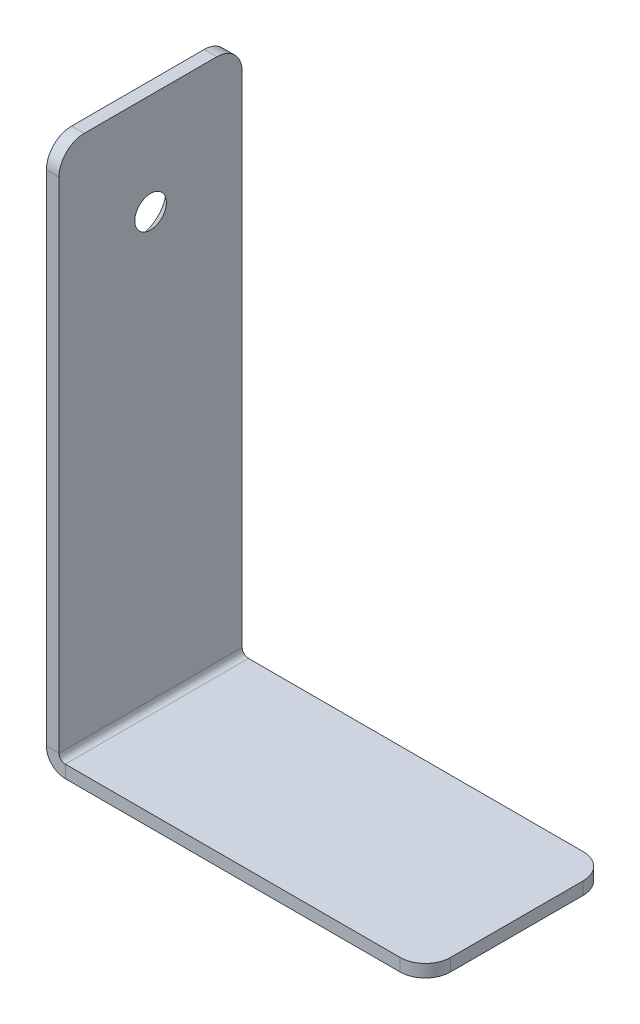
ISO-10303-21;
HEADER;
FILE_DESCRIPTION(('STEP AP214'),'2;1');
FILE_NAME('part.step','',(''),(''),'','','');
FILE_SCHEMA(('AUTOMOTIVE_DESIGN { 1 0 10303 214 1 1 1 1 }'));
ENDSEC;
DATA;
#1=APPLICATION_CONTEXT('core data for automotive mechanical design processes');
#2=APPLICATION_PROTOCOL_DEFINITION('international standard','automotive_design',2000,#1);
#3=PRODUCT_CONTEXT('',#1,'mechanical');
#4=PRODUCT('Part','Part','',(#3));
#5=PRODUCT_RELATED_PRODUCT_CATEGORY('part','',(#4));
#6=PRODUCT_DEFINITION_FORMATION('','',#4);
#7=PRODUCT_DEFINITION_CONTEXT('part definition',#1,'design');
#8=PRODUCT_DEFINITION('design','',#6,#7);
#9=PRODUCT_DEFINITION_SHAPE('','',#8);
#10=(LENGTH_UNIT() NAMED_UNIT(*) SI_UNIT(.MILLI.,.METRE.));
#11=(NAMED_UNIT(*) PLANE_ANGLE_UNIT() SI_UNIT($,.RADIAN.));
#12=(NAMED_UNIT(*) SI_UNIT($,.STERADIAN.) SOLID_ANGLE_UNIT());
#13=UNCERTAINTY_MEASURE_WITH_UNIT(LENGTH_MEASURE(1.E-05),#10,'distance_accuracy_value','');
#14=(GEOMETRIC_REPRESENTATION_CONTEXT(3) GLOBAL_UNCERTAINTY_ASSIGNED_CONTEXT((#13)) GLOBAL_UNIT_ASSIGNED_CONTEXT((#10,
#11,#12)) REPRESENTATION_CONTEXT('',''));
#15=CARTESIAN_POINT('',(0.,0.,0.));
#16=DIRECTION('',(0.,0.,1.));
#17=DIRECTION('',(1.,0.,0.));
#18=AXIS2_PLACEMENT_3D('',#15,#16,#17);
#19=CARTESIAN_POINT('',(0.,1.5,7.25));
#20=DIRECTION('',(0.,0.,1.));
#21=DIRECTION('',(1.,0.,0.));
#22=AXIS2_PLACEMENT_3D('',#19,#20,#21);
#23=PLANE('',#22);
#24=DIRECTION('',(1.,0.,0.));
#25=VECTOR('',#24,1.);
#26=CARTESIAN_POINT('',(0.,1.5,7.25));
#27=LINE('',#26,#25);
#28=CARTESIAN_POINT('',(0.,1.5,7.25));
#29=VERTEX_POINT('',#28);
#30=CARTESIAN_POINT('',(1.,1.5,7.25));
#31=VERTEX_POINT('',#30);
#32=EDGE_CURVE('E137',#29,#31,#27,.T.);
#33=ORIENTED_EDGE('',*,*,#32,.F.);
#34=CARTESIAN_POINT('',(1.5,1.5,7.25));
#35=DIRECTION('',(0.,0.,-1.));
#36=DIRECTION('',(-1.,0.,0.));
#37=AXIS2_PLACEMENT_3D('',#34,#35,#36);
#38=CIRCLE('',#37,1.5);
#39=CARTESIAN_POINT('',(1.5,0.,7.25));
#40=VERTEX_POINT('',#39);
#41=EDGE_CURVE('E135',#29,#40,#38,.F.);
#42=ORIENTED_EDGE('',*,*,#41,.T.);
#43=DIRECTION('',(0.,-1.,0.));
#44=VECTOR('',#43,1.);
#45=CARTESIAN_POINT('',(1.5,1.,7.25));
#46=LINE('',#45,#44);
#47=CARTESIAN_POINT('',(1.5,1.,7.25));
#48=VERTEX_POINT('',#47);
#49=EDGE_CURVE('E129',#48,#40,#46,.T.);
#50=ORIENTED_EDGE('',*,*,#49,.F.);
#51=CARTESIAN_POINT('',(1.5,1.5,7.25));
#52=DIRECTION('',(0.,0.,1.));
#53=DIRECTION('',(1.,0.,0.));
#54=AXIS2_PLACEMENT_3D('',#51,#52,#53);
#55=CIRCLE('',#54,0.5);
#56=EDGE_CURVE('E133',#31,#48,#55,.T.);
#57=ORIENTED_EDGE('',*,*,#56,.F.);
#58=EDGE_LOOP('',(#33,#42,#50,#57));
#59=FACE_BOUND('',#58,.T.);
#60=ADVANCED_FACE('F36',(#59),#23,.T.);
#61=CARTESIAN_POINT('',(1.5,1.,7.25));
#62=DIRECTION('',(0.,0.,1.));
#63=DIRECTION('',(1.,0.,0.));
#64=AXIS2_PLACEMENT_3D('',#61,#62,#63);
#65=PLANE('',#64);
#66=DIRECTION('',(0.,-1.,0.));
#67=VECTOR('',#66,1.);
#68=CARTESIAN_POINT('',(0.999999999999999,43.,7.25));
#69=LINE('',#68,#67);
#70=CARTESIAN_POINT('',(0.999999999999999,41.,7.25));
#71=VERTEX_POINT('',#70);
#72=EDGE_CURVE('E158',#71,#31,#69,.T.);
#73=ORIENTED_EDGE('',*,*,#72,.F.);
#74=DIRECTION('',(1.,0.,0.));
#75=VECTOR('',#74,1.);
#76=CARTESIAN_POINT('',(1.5,41.,7.25));
#77=LINE('',#76,#75);
#78=CARTESIAN_POINT('',(0.,41.,7.25));
#79=VERTEX_POINT('',#78);
#80=EDGE_CURVE('E212',#71,#79,#77,.F.);
#81=ORIENTED_EDGE('',*,*,#80,.T.);
#82=DIRECTION('',(0.,-1.,0.));
#83=VECTOR('',#82,1.);
#84=CARTESIAN_POINT('',(0.,43.,7.25));
#85=LINE('',#84,#83);
#86=EDGE_CURVE('E160',#79,#29,#85,.T.);
#87=ORIENTED_EDGE('',*,*,#86,.T.);
#88=ORIENTED_EDGE('',*,*,#32,.T.);
#89=EDGE_LOOP('',(#73,#81,#87,#88));
#90=FACE_BOUND('',#89,.T.);
#91=ADVANCED_FACE('F295',(#90),#65,.T.);
#92=CARTESIAN_POINT('',(1.5,0.,-7.25));
#93=DIRECTION('',(0.,0.,-1.));
#94=DIRECTION('',(-1.,0.,0.));
#95=AXIS2_PLACEMENT_3D('',#92,#93,#94);
#96=PLANE('',#95);
#97=DIRECTION('',(0.,1.,0.));
#98=VECTOR('',#97,1.);
#99=CARTESIAN_POINT('',(1.5,0.,-7.25));
#100=LINE('',#99,#98);
#101=CARTESIAN_POINT('',(1.5,0.,-7.25));
#102=VERTEX_POINT('',#101);
#103=CARTESIAN_POINT('',(1.5,1.,-7.25));
#104=VERTEX_POINT('',#103);
#105=EDGE_CURVE('E138',#102,#104,#100,.T.);
#106=ORIENTED_EDGE('',*,*,#105,.F.);
#107=CARTESIAN_POINT('',(1.5,1.5,-7.25));
#108=DIRECTION('',(0.,0.,-1.));
#109=DIRECTION('',(-1.,0.,0.));
#110=AXIS2_PLACEMENT_3D('',#107,#108,#109);
#111=CIRCLE('',#110,1.5);
#112=CARTESIAN_POINT('',(0.,1.5,-7.25));
#113=VERTEX_POINT('',#112);
#114=EDGE_CURVE('E178',#113,#102,#111,.F.);
#115=ORIENTED_EDGE('',*,*,#114,.F.);
#116=DIRECTION('',(-1.,0.,0.));
#117=VECTOR('',#116,1.);
#118=CARTESIAN_POINT('',(1.,1.5,-7.25));
#119=LINE('',#118,#117);
#120=CARTESIAN_POINT('',(1.,1.5,-7.25));
#121=VERTEX_POINT('',#120);
#122=EDGE_CURVE('E197',#121,#113,#119,.T.);
#123=ORIENTED_EDGE('',*,*,#122,.F.);
#124=CARTESIAN_POINT('',(1.5,1.5,-7.25));
#125=DIRECTION('',(0.,0.,1.));
#126=DIRECTION('',(1.,0.,0.));
#127=AXIS2_PLACEMENT_3D('',#124,#125,#126);
#128=CIRCLE('',#127,0.5);
#129=EDGE_CURVE('E172',#121,#104,#128,.T.);
#130=ORIENTED_EDGE('',*,*,#129,.T.);
#131=EDGE_LOOP('',(#106,#115,#123,#130));
#132=FACE_BOUND('',#131,.T.);
#133=ADVANCED_FACE('F284',(#132),#96,.T.);
#134=CARTESIAN_POINT('',(1.,1.5,-7.25));
#135=DIRECTION('',(0.,0.,-1.));
#136=DIRECTION('',(-1.,0.,0.));
#137=AXIS2_PLACEMENT_3D('',#134,#135,#136);
#138=PLANE('',#137);
#139=DIRECTION('',(1.,0.,0.));
#140=VECTOR('',#139,1.);
#141=CARTESIAN_POINT('',(0.,1.,-7.25));
#142=LINE('',#141,#140);
#143=CARTESIAN_POINT('',(28.,1.,-7.25));
#144=VERTEX_POINT('',#143);
#145=EDGE_CURVE('E145',#104,#144,#142,.T.);
#146=ORIENTED_EDGE('',*,*,#145,.T.);
#147=DIRECTION('',(0.,-1.,0.));
#148=VECTOR('',#147,1.);
#149=CARTESIAN_POINT('',(28.,1.5,-7.25));
#150=LINE('',#149,#148);
#151=CARTESIAN_POINT('',(28.,0.,-7.25));
#152=VERTEX_POINT('',#151);
#153=EDGE_CURVE('E11',#144,#152,#150,.T.);
#154=ORIENTED_EDGE('',*,*,#153,.T.);
#155=DIRECTION('',(1.,0.,0.));
#156=VECTOR('',#155,1.);
#157=CARTESIAN_POINT('',(0.,0.,-7.25));
#158=LINE('',#157,#156);
#159=EDGE_CURVE('E167',#102,#152,#158,.T.);
#160=ORIENTED_EDGE('',*,*,#159,.F.);
#161=ORIENTED_EDGE('',*,*,#105,.T.);
#162=EDGE_LOOP('',(#146,#154,#160,#161));
#163=FACE_BOUND('',#162,.T.);
#164=ADVANCED_FACE('F287',(#163),#138,.T.);
#165=CARTESIAN_POINT('',(0.,0.,7.25));
#166=DIRECTION('',(0.,1.,0.));
#167=DIRECTION('',(0.,0.,1.));
#168=AXIS2_PLACEMENT_3D('',#165,#166,#167);
#169=PLANE('',#168);
#170=DIRECTION('',(0.,0.,-1.));
#171=VECTOR('',#170,1.);
#172=CARTESIAN_POINT('',(30.,0.,7.25));
#173=LINE('',#172,#171);
#174=CARTESIAN_POINT('',(30.,0.,5.25));
#175=VERTEX_POINT('',#174);
#176=CARTESIAN_POINT('',(30.,0.,-5.25));
#177=VERTEX_POINT('',#176);
#178=EDGE_CURVE('E194',#175,#177,#173,.T.);
#179=ORIENTED_EDGE('',*,*,#178,.F.);
#180=CARTESIAN_POINT('',(28.,0.,5.25));
#181=DIRECTION('',(0.,1.,0.));
#182=DIRECTION('',(0.,0.,1.));
#183=AXIS2_PLACEMENT_3D('',#180,#181,#182);
#184=CIRCLE('',#183,2.);
#185=CARTESIAN_POINT('',(28.,0.,7.25));
#186=VERTEX_POINT('',#185);
#187=EDGE_CURVE('E228',#175,#186,#184,.F.);
#188=ORIENTED_EDGE('',*,*,#187,.T.);
#189=DIRECTION('',(1.,0.,0.));
#190=VECTOR('',#189,1.);
#191=CARTESIAN_POINT('',(0.,0.,7.25));
#192=LINE('',#191,#190);
#193=EDGE_CURVE('E153',#40,#186,#192,.T.);
#194=ORIENTED_EDGE('',*,*,#193,.F.);
#195=DIRECTION('',(0.,0.,-1.));
#196=VECTOR('',#195,1.);
#197=CARTESIAN_POINT('',(1.5,0.,7.25));
#198=LINE('',#197,#196);
#199=EDGE_CURVE('E166',#40,#102,#198,.T.);
#200=ORIENTED_EDGE('',*,*,#199,.T.);
#201=ORIENTED_EDGE('',*,*,#159,.T.);
#202=CARTESIAN_POINT('',(28.,0.,-5.25));
#203=DIRECTION('',(0.,1.,0.));
#204=DIRECTION('',(0.,0.,1.));
#205=AXIS2_PLACEMENT_3D('',#202,#203,#204);
#206=CIRCLE('',#205,2.);
#207=EDGE_CURVE('E226',#152,#177,#206,.F.);
#208=ORIENTED_EDGE('',*,*,#207,.T.);
#209=EDGE_LOOP('',(#179,#188,#194,#200,#201,#208));
#210=FACE_BOUND('',#209,.T.);
#211=ADVANCED_FACE('F241',(#210),#169,.F.);
#212=CARTESIAN_POINT('',(30.,1.,7.25));
#213=DIRECTION('',(1.,0.,0.));
#214=DIRECTION('',(0.,0.,-1.));
#215=AXIS2_PLACEMENT_3D('',#212,#213,#214);
#216=PLANE('',#215);
#217=DIRECTION('',(0.,0.,-1.));
#218=VECTOR('',#217,1.);
#219=CARTESIAN_POINT('',(30.,1.,7.25));
#220=LINE('',#219,#218);
#221=CARTESIAN_POINT('',(30.,1.,5.25));
#222=VERTEX_POINT('',#221);
#223=CARTESIAN_POINT('',(30.,1.,-5.25));
#224=VERTEX_POINT('',#223);
#225=EDGE_CURVE('E149',#222,#224,#220,.T.);
#226=ORIENTED_EDGE('',*,*,#225,.F.);
#227=DIRECTION('',(0.,-1.,0.));
#228=VECTOR('',#227,1.);
#229=CARTESIAN_POINT('',(30.,1.,5.25));
#230=LINE('',#229,#228);
#231=EDGE_CURVE('E223',#222,#175,#230,.T.);
#232=ORIENTED_EDGE('',*,*,#231,.T.);
#233=ORIENTED_EDGE('',*,*,#178,.T.);
#234=DIRECTION('',(0.,-1.,0.));
#235=VECTOR('',#234,1.);
#236=CARTESIAN_POINT('',(30.,1.,-5.25));
#237=LINE('',#236,#235);
#238=EDGE_CURVE('E221',#177,#224,#237,.F.);
#239=ORIENTED_EDGE('',*,*,#238,.T.);
#240=EDGE_LOOP('',(#226,#232,#233,#239));
#241=FACE_BOUND('',#240,.T.);
#242=ADVANCED_FACE('F235',(#241),#216,.T.);
#243=CARTESIAN_POINT('',(0.,1.,7.25));
#244=DIRECTION('',(0.,1.,0.));
#245=DIRECTION('',(0.,0.,1.));
#246=AXIS2_PLACEMENT_3D('',#243,#244,#245);
#247=PLANE('',#246);
#248=DIRECTION('',(1.,0.,0.));
#249=VECTOR('',#248,1.);
#250=CARTESIAN_POINT('',(0.,1.,7.25));
#251=LINE('',#250,#249);
#252=CARTESIAN_POINT('',(28.,1.,7.25));
#253=VERTEX_POINT('',#252);
#254=EDGE_CURVE('E143',#48,#253,#251,.T.);
#255=ORIENTED_EDGE('',*,*,#254,.T.);
#256=CARTESIAN_POINT('',(28.,1.,5.25));
#257=DIRECTION('',(0.,1.,0.));
#258=DIRECTION('',(0.,0.,1.));
#259=AXIS2_PLACEMENT_3D('',#256,#257,#258);
#260=CIRCLE('',#259,2.);
#261=EDGE_CURVE('E44',#253,#222,#260,.T.);
#262=ORIENTED_EDGE('',*,*,#261,.T.);
#263=ORIENTED_EDGE('',*,*,#225,.T.);
#264=CARTESIAN_POINT('',(28.,1.,-5.25));
#265=DIRECTION('',(0.,1.,0.));
#266=DIRECTION('',(0.,0.,1.));
#267=AXIS2_PLACEMENT_3D('',#264,#265,#266);
#268=CIRCLE('',#267,2.);
#269=EDGE_CURVE('E51',#224,#144,#268,.T.);
#270=ORIENTED_EDGE('',*,*,#269,.T.);
#271=ORIENTED_EDGE('',*,*,#145,.F.);
#272=DIRECTION('',(0.,0.,-1.));
#273=VECTOR('',#272,1.);
#274=CARTESIAN_POINT('',(1.5,1.,7.25));
#275=LINE('',#274,#273);
#276=EDGE_CURVE('E141',#48,#104,#275,.T.);
#277=ORIENTED_EDGE('',*,*,#276,.F.);
#278=EDGE_LOOP('',(#255,#262,#263,#270,#271,#277));
#279=FACE_BOUND('',#278,.T.);
#280=ADVANCED_FACE('F142',(#279),#247,.T.);
#281=CARTESIAN_POINT('',(1.5,1.5,7.25));
#282=DIRECTION('',(0.,0.,-1.));
#283=DIRECTION('',(-1.,0.,0.));
#284=AXIS2_PLACEMENT_3D('',#281,#282,#283);
#285=CYLINDRICAL_SURFACE('',#284,0.5);
#286=ORIENTED_EDGE('',*,*,#129,.F.);
#287=DIRECTION('',(0.,0.,-1.));
#288=VECTOR('',#287,1.);
#289=CARTESIAN_POINT('',(1.,1.5,7.25));
#290=LINE('',#289,#288);
#291=EDGE_CURVE('E150',#31,#121,#290,.T.);
#292=ORIENTED_EDGE('',*,*,#291,.F.);
#293=ORIENTED_EDGE('',*,*,#56,.T.);
#294=ORIENTED_EDGE('',*,*,#276,.T.);
#295=EDGE_LOOP('',(#286,#292,#293,#294));
#296=FACE_BOUND('',#295,.T.);
#297=ADVANCED_FACE('F156',(#296),#285,.F.);
#298=CARTESIAN_POINT('',(0.999999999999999,43.,7.25));
#299=DIRECTION('',(1.,0.,0.));
#300=DIRECTION('',(0.,1.,0.));
#301=AXIS2_PLACEMENT_3D('',#298,#299,#300);
#302=PLANE('',#301);
#303=CARTESIAN_POINT('',(0.999999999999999,35.,0.));
#304=DIRECTION('',(1.,0.,0.));
#305=DIRECTION('',(0.,1.,0.));
#306=AXIS2_PLACEMENT_3D('',#303,#304,#305);
#307=CIRCLE('',#306,1.25000000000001);
#308=CARTESIAN_POINT('',(0.999999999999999,36.25,0.));
#309=VERTEX_POINT('',#308);
#310=EDGE_CURVE('E170',#309,#309,#307,.T.);
#311=ORIENTED_EDGE('',*,*,#310,.F.);
#312=EDGE_LOOP('',(#311));
#313=FACE_BOUND('',#312,.T.);
#314=DIRECTION('',(0.,0.,-1.));
#315=VECTOR('',#314,1.);
#316=CARTESIAN_POINT('',(0.999999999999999,43.,7.25));
#317=LINE('',#316,#315);
#318=CARTESIAN_POINT('',(0.999999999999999,43.,5.25));
#319=VERTEX_POINT('',#318);
#320=CARTESIAN_POINT('',(0.999999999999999,43.,-5.25));
#321=VERTEX_POINT('',#320);
#322=EDGE_CURVE('E189',#319,#321,#317,.T.);
#323=ORIENTED_EDGE('',*,*,#322,.F.);
#324=CARTESIAN_POINT('',(0.999999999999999,41.,5.25));
#325=DIRECTION('',(1.,0.,0.));
#326=DIRECTION('',(0.,1.,0.));
#327=AXIS2_PLACEMENT_3D('',#324,#325,#326);
#328=CIRCLE('',#327,2.);
#329=EDGE_CURVE('E210',#319,#71,#328,.T.);
#330=ORIENTED_EDGE('',*,*,#329,.T.);
#331=ORIENTED_EDGE('',*,*,#72,.T.);
#332=ORIENTED_EDGE('',*,*,#291,.T.);
#333=DIRECTION('',(0.,-1.,0.));
#334=VECTOR('',#333,1.);
#335=CARTESIAN_POINT('',(0.999999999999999,43.,-7.25));
#336=LINE('',#335,#334);
#337=CARTESIAN_POINT('',(0.999999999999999,41.,-7.25));
#338=VERTEX_POINT('',#337);
#339=EDGE_CURVE('E174',#338,#121,#336,.T.);
#340=ORIENTED_EDGE('',*,*,#339,.F.);
#341=CARTESIAN_POINT('',(0.999999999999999,41.,-5.25));
#342=DIRECTION('',(1.,0.,0.));
#343=DIRECTION('',(0.,1.,0.));
#344=AXIS2_PLACEMENT_3D('',#341,#342,#343);
#345=CIRCLE('',#344,2.);
#346=EDGE_CURVE('E208',#338,#321,#345,.T.);
#347=ORIENTED_EDGE('',*,*,#346,.T.);
#348=EDGE_LOOP('',(#323,#330,#331,#332,#340,#347));
#349=FACE_BOUND('',#348,.T.);
#350=ADVANCED_FACE('F270',(#313,#349),#302,.T.);
#351=CARTESIAN_POINT('',(0.,43.,7.25));
#352=DIRECTION('',(0.,1.,0.));
#353=DIRECTION('',(0.,0.,1.));
#354=AXIS2_PLACEMENT_3D('',#351,#352,#353);
#355=PLANE('',#354);
#356=DIRECTION('',(0.,0.,-1.));
#357=VECTOR('',#356,1.);
#358=CARTESIAN_POINT('',(0.,43.,7.25));
#359=LINE('',#358,#357);
#360=CARTESIAN_POINT('',(0.,43.,5.25));
#361=VERTEX_POINT('',#360);
#362=CARTESIAN_POINT('',(0.,43.,-5.25));
#363=VERTEX_POINT('',#362);
#364=EDGE_CURVE('E186',#361,#363,#359,.T.);
#365=ORIENTED_EDGE('',*,*,#364,.F.);
#366=DIRECTION('',(1.,0.,0.));
#367=VECTOR('',#366,1.);
#368=CARTESIAN_POINT('',(0.,43.,5.25));
#369=LINE('',#368,#367);
#370=EDGE_CURVE('E205',#361,#319,#369,.T.);
#371=ORIENTED_EDGE('',*,*,#370,.T.);
#372=ORIENTED_EDGE('',*,*,#322,.T.);
#373=DIRECTION('',(1.,0.,0.));
#374=VECTOR('',#373,1.);
#375=CARTESIAN_POINT('',(0.,43.,-5.25));
#376=LINE('',#375,#374);
#377=EDGE_CURVE('E203',#321,#363,#376,.F.);
#378=ORIENTED_EDGE('',*,*,#377,.T.);
#379=EDGE_LOOP('',(#365,#371,#372,#378));
#380=FACE_BOUND('',#379,.T.);
#381=ADVANCED_FACE('F255',(#380),#355,.T.);
#382=CARTESIAN_POINT('',(0.,43.,7.25));
#383=DIRECTION('',(1.,0.,0.));
#384=DIRECTION('',(0.,1.,0.));
#385=AXIS2_PLACEMENT_3D('',#382,#383,#384);
#386=PLANE('',#385);
#387=CARTESIAN_POINT('',(0.,35.,0.));
#388=DIRECTION('',(-1.,0.,0.));
#389=DIRECTION('',(0.,0.,1.));
#390=AXIS2_PLACEMENT_3D('',#387,#388,#389);
#391=CIRCLE('',#390,2.25);
#392=CARTESIAN_POINT('',(0.,35.,2.25000000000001));
#393=VERTEX_POINT('',#392);
#394=EDGE_CURVE('E245',#393,#393,#391,.T.);
#395=ORIENTED_EDGE('',*,*,#394,.F.);
#396=EDGE_LOOP('',(#395));
#397=FACE_BOUND('',#396,.T.);
#398=ORIENTED_EDGE('',*,*,#86,.F.);
#399=CARTESIAN_POINT('',(0.,41.,5.25));
#400=DIRECTION('',(1.,0.,0.));
#401=DIRECTION('',(0.,1.,0.));
#402=AXIS2_PLACEMENT_3D('',#399,#400,#401);
#403=CIRCLE('',#402,2.);
#404=EDGE_CURVE('E216',#79,#361,#403,.F.);
#405=ORIENTED_EDGE('',*,*,#404,.T.);
#406=ORIENTED_EDGE('',*,*,#364,.T.);
#407=CARTESIAN_POINT('',(0.,41.,-5.25));
#408=DIRECTION('',(1.,0.,0.));
#409=DIRECTION('',(0.,1.,0.));
#410=AXIS2_PLACEMENT_3D('',#407,#408,#409);
#411=CIRCLE('',#410,2.);
#412=CARTESIAN_POINT('',(0.,41.,-7.25));
#413=VERTEX_POINT('',#412);
#414=EDGE_CURVE('E214',#363,#413,#411,.F.);
#415=ORIENTED_EDGE('',*,*,#414,.T.);
#416=DIRECTION('',(0.,-1.,0.));
#417=VECTOR('',#416,1.);
#418=CARTESIAN_POINT('',(0.,43.,-7.25));
#419=LINE('',#418,#417);
#420=EDGE_CURVE('E176',#413,#113,#419,.T.);
#421=ORIENTED_EDGE('',*,*,#420,.T.);
#422=DIRECTION('',(0.,0.,-1.));
#423=VECTOR('',#422,1.);
#424=CARTESIAN_POINT('',(0.,1.5,7.25));
#425=LINE('',#424,#423);
#426=EDGE_CURVE('E183',#29,#113,#425,.T.);
#427=ORIENTED_EDGE('',*,*,#426,.F.);
#428=EDGE_LOOP('',(#398,#405,#406,#415,#421,#427));
#429=FACE_BOUND('',#428,.T.);
#430=ADVANCED_FACE('F251',(#397,#429),#386,.F.);
#431=CARTESIAN_POINT('',(1.5,1.5,7.25));
#432=DIRECTION('',(0.,0.,-1.));
#433=DIRECTION('',(-1.,0.,0.));
#434=AXIS2_PLACEMENT_3D('',#431,#432,#433);
#435=CYLINDRICAL_SURFACE('',#434,1.5);
#436=ORIENTED_EDGE('',*,*,#114,.T.);
#437=ORIENTED_EDGE('',*,*,#199,.F.);
#438=ORIENTED_EDGE('',*,*,#41,.F.);
#439=ORIENTED_EDGE('',*,*,#426,.T.);
#440=EDGE_LOOP('',(#436,#437,#438,#439));
#441=FACE_BOUND('',#440,.T.);
#442=ADVANCED_FACE('F254',(#441),#435,.T.);
#443=CARTESIAN_POINT('',(1.5,1.5,7.25));
#444=DIRECTION('',(0.,0.,1.));
#445=DIRECTION('',(1.,0.,0.));
#446=AXIS2_PLACEMENT_3D('',#443,#444,#445);
#447=PLANE('',#446);
#448=ORIENTED_EDGE('',*,*,#193,.T.);
#449=DIRECTION('',(0.,-1.,0.));
#450=VECTOR('',#449,1.);
#451=CARTESIAN_POINT('',(28.,1.5,7.25));
#452=LINE('',#451,#450);
#453=EDGE_CURVE('E59',#186,#253,#452,.F.);
#454=ORIENTED_EDGE('',*,*,#453,.T.);
#455=ORIENTED_EDGE('',*,*,#254,.F.);
#456=ORIENTED_EDGE('',*,*,#49,.T.);
#457=EDGE_LOOP('',(#448,#454,#455,#456));
#458=FACE_BOUND('',#457,.T.);
#459=ADVANCED_FACE('F152',(#458),#447,.T.);
#460=CARTESIAN_POINT('',(1.5,1.5,-7.25));
#461=DIRECTION('',(0.,0.,1.));
#462=DIRECTION('',(1.,0.,0.));
#463=AXIS2_PLACEMENT_3D('',#460,#461,#462);
#464=PLANE('',#463);
#465=ORIENTED_EDGE('',*,*,#420,.F.);
#466=DIRECTION('',(1.,0.,0.));
#467=VECTOR('',#466,1.);
#468=CARTESIAN_POINT('',(0.999999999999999,41.,-7.25));
#469=LINE('',#468,#467);
#470=EDGE_CURVE('E218',#413,#338,#469,.T.);
#471=ORIENTED_EDGE('',*,*,#470,.T.);
#472=ORIENTED_EDGE('',*,*,#339,.T.);
#473=ORIENTED_EDGE('',*,*,#122,.T.);
#474=EDGE_LOOP('',(#465,#471,#472,#473));
#475=FACE_BOUND('',#474,.T.);
#476=ADVANCED_FACE('F279',(#475),#464,.F.);
#477=CARTESIAN_POINT('',(0.,35.,0.));
#478=DIRECTION('',(-1.,0.,0.));
#479=DIRECTION('',(0.,0.,1.));
#480=AXIS2_PLACEMENT_3D('',#477,#478,#479);
#481=CONICAL_SURFACE('',#480,2.25,0.785398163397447);
#482=ORIENTED_EDGE('',*,*,#310,.T.);
#483=EDGE_LOOP('',(#482));
#484=FACE_BOUND('',#483,.T.);
#485=ORIENTED_EDGE('',*,*,#394,.T.);
#486=EDGE_LOOP('',(#485));
#487=FACE_BOUND('',#486,.T.);
#488=ADVANCED_FACE('F249',(#484,#487),#481,.F.);
#489=CARTESIAN_POINT('',(0.,41.,5.25));
#490=DIRECTION('',(1.,0.,0.));
#491=DIRECTION('',(0.,0.,-1.));
#492=AXIS2_PLACEMENT_3D('',#489,#490,#491);
#493=CYLINDRICAL_SURFACE('',#492,2.);
#494=ORIENTED_EDGE('',*,*,#404,.F.);
#495=ORIENTED_EDGE('',*,*,#80,.F.);
#496=ORIENTED_EDGE('',*,*,#329,.F.);
#497=ORIENTED_EDGE('',*,*,#370,.F.);
#498=EDGE_LOOP('',(#494,#495,#496,#497));
#499=FACE_BOUND('',#498,.T.);
#500=ADVANCED_FACE('F265',(#499),#493,.T.);
#501=CARTESIAN_POINT('',(1.5,41.,-5.25));
#502=DIRECTION('',(-1.,0.,0.));
#503=DIRECTION('',(0.,0.,1.));
#504=AXIS2_PLACEMENT_3D('',#501,#502,#503);
#505=CYLINDRICAL_SURFACE('',#504,2.);
#506=ORIENTED_EDGE('',*,*,#414,.F.);
#507=ORIENTED_EDGE('',*,*,#377,.F.);
#508=ORIENTED_EDGE('',*,*,#346,.F.);
#509=ORIENTED_EDGE('',*,*,#470,.F.);
#510=EDGE_LOOP('',(#506,#507,#508,#509));
#511=FACE_BOUND('',#510,.T.);
#512=ADVANCED_FACE('F276',(#511),#505,.T.);
#513=CARTESIAN_POINT('',(28.,1.,5.25));
#514=DIRECTION('',(0.,-1.,0.));
#515=DIRECTION('',(0.,0.,-1.));
#516=AXIS2_PLACEMENT_3D('',#513,#514,#515);
#517=CYLINDRICAL_SURFACE('',#516,2.);
#518=ORIENTED_EDGE('',*,*,#261,.F.);
#519=ORIENTED_EDGE('',*,*,#453,.F.);
#520=ORIENTED_EDGE('',*,*,#187,.F.);
#521=ORIENTED_EDGE('',*,*,#231,.F.);
#522=EDGE_LOOP('',(#518,#519,#520,#521));
#523=FACE_BOUND('',#522,.T.);
#524=ADVANCED_FACE('F238',(#523),#517,.T.);
#525=CARTESIAN_POINT('',(28.,1.5,-5.25));
#526=DIRECTION('',(0.,-1.,0.));
#527=DIRECTION('',(0.,0.,-1.));
#528=AXIS2_PLACEMENT_3D('',#525,#526,#527);
#529=CYLINDRICAL_SURFACE('',#528,2.);
#530=ORIENTED_EDGE('',*,*,#269,.F.);
#531=ORIENTED_EDGE('',*,*,#238,.F.);
#532=ORIENTED_EDGE('',*,*,#207,.F.);
#533=ORIENTED_EDGE('',*,*,#153,.F.);
#534=EDGE_LOOP('',(#530,#531,#532,#533));
#535=FACE_BOUND('',#534,.T.);
#536=ADVANCED_FACE('F38',(#535),#529,.T.);
#537=CLOSED_SHELL('',(#60,#91,#133,#164,#211,#242,#280,#297,#350,#381,#430,#442,#459,#476,#488,
#500,#512,#524,#536));
#538=MANIFOLD_SOLID_BREP('B2',#537);
#539=ADVANCED_BREP_SHAPE_REPRESENTATION('',(#18,#538),#14);
#540=SHAPE_DEFINITION_REPRESENTATION(#9,#539);
ENDSEC;
END-ISO-10303-21;
